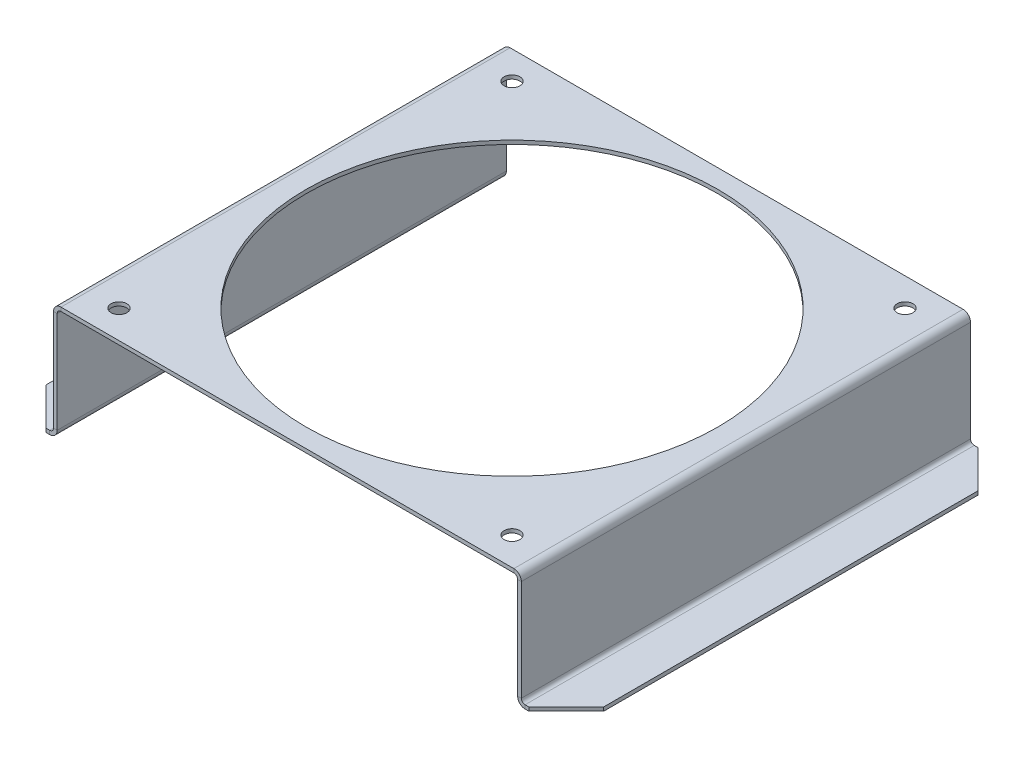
ISO-10303-21;
HEADER;
FILE_DESCRIPTION(('STEP AP214'),'2;1');
FILE_NAME('part.step','',(''),(''),'','','');
FILE_SCHEMA(('AUTOMOTIVE_DESIGN { 1 0 10303 214 1 1 1 1 }'));
ENDSEC;
DATA;
#1=APPLICATION_CONTEXT('core data for automotive mechanical design processes');
#2=APPLICATION_PROTOCOL_DEFINITION('international standard','automotive_design',2000,#1);
#3=PRODUCT_CONTEXT('',#1,'mechanical');
#4=PRODUCT('Part','Part','',(#3));
#5=PRODUCT_RELATED_PRODUCT_CATEGORY('part','',(#4));
#6=PRODUCT_DEFINITION_FORMATION('','',#4);
#7=PRODUCT_DEFINITION_CONTEXT('part definition',#1,'design');
#8=PRODUCT_DEFINITION('design','',#6,#7);
#9=PRODUCT_DEFINITION_SHAPE('','',#8);
#10=(LENGTH_UNIT() NAMED_UNIT(*) SI_UNIT(.MILLI.,.METRE.));
#11=(NAMED_UNIT(*) PLANE_ANGLE_UNIT() SI_UNIT($,.RADIAN.));
#12=(NAMED_UNIT(*) SI_UNIT($,.STERADIAN.) SOLID_ANGLE_UNIT());
#13=UNCERTAINTY_MEASURE_WITH_UNIT(LENGTH_MEASURE(1.E-05),#10,'distance_accuracy_value','');
#14=(GEOMETRIC_REPRESENTATION_CONTEXT(3) GLOBAL_UNCERTAINTY_ASSIGNED_CONTEXT((#13)) GLOBAL_UNIT_ASSIGNED_CONTEXT((#10,
#11,#12)) REPRESENTATION_CONTEXT('',''));
#15=CARTESIAN_POINT('',(0.,0.,0.));
#16=DIRECTION('',(0.,0.,1.));
#17=DIRECTION('',(1.,0.,0.));
#18=AXIS2_PLACEMENT_3D('',#15,#16,#17);
#19=CARTESIAN_POINT('',(-62.4999999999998,-29.,60.));
#20=DIRECTION('',(0.,0.,0.999999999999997));
#21=DIRECTION('',(0.999999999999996,0.,0.));
#22=AXIS2_PLACEMENT_3D('',#19,#20,#21);
#23=PLANE('',#22);
#24=DIRECTION('',(0.999999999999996,0.,0.));
#25=VECTOR('',#24,1.);
#26=CARTESIAN_POINT('',(-62.4999999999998,-29.,60.));
#27=LINE('',#26,#25);
#28=CARTESIAN_POINT('',(-62.4999999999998,-29.,60.));
#29=VERTEX_POINT('',#28);
#30=CARTESIAN_POINT('',(-61.4999999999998,-29.,60.));
#31=VERTEX_POINT('',#30);
#32=EDGE_CURVE('E412',#29,#31,#27,.T.);
#33=ORIENTED_EDGE('',*,*,#32,.F.);
#34=CARTESIAN_POINT('',(-63.4999999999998,-28.9999999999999,59.9999999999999));
#35=DIRECTION('',(0.,0.,-0.999999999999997));
#36=DIRECTION('',(-0.999999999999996,0.,0.));
#37=AXIS2_PLACEMENT_3D('',#34,#35,#36);
#38=CIRCLE('',#37,1.);
#39=CARTESIAN_POINT('',(-63.4999999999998,-29.9999999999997,59.9999999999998));
#40=VERTEX_POINT('',#39);
#41=EDGE_CURVE('E257',#40,#29,#38,.F.);
#42=ORIENTED_EDGE('',*,*,#41,.F.);
#43=DIRECTION('',(0.,1.,0.));
#44=VECTOR('',#43,1.);
#45=CARTESIAN_POINT('',(-63.4999999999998,-31.,59.9999999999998));
#46=LINE('',#45,#44);
#47=CARTESIAN_POINT('',(-63.4999999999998,-31.,59.9999999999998));
#48=VERTEX_POINT('',#47);
#49=EDGE_CURVE('E409',#48,#40,#46,.T.);
#50=ORIENTED_EDGE('',*,*,#49,.F.);
#51=CARTESIAN_POINT('',(-63.4999999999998,-28.9999999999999,59.9999999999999));
#52=DIRECTION('',(0.,0.,0.999999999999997));
#53=DIRECTION('',(0.999999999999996,0.,0.));
#54=AXIS2_PLACEMENT_3D('',#51,#52,#53);
#55=CIRCLE('',#54,2.);
#56=EDGE_CURVE('E264',#48,#31,#55,.T.);
#57=ORIENTED_EDGE('',*,*,#56,.T.);
#58=EDGE_LOOP('',(#33,#42,#50,#57));
#59=FACE_BOUND('',#58,.T.);
#60=ADVANCED_FACE('F38',(#59),#23,.T.);
#61=CARTESIAN_POINT('',(-63.4999999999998,-31.,59.9999999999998));
#62=DIRECTION('',(0.,0.,0.999999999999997));
#63=DIRECTION('',(0.999999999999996,0.,0.));
#64=AXIS2_PLACEMENT_3D('',#61,#62,#63);
#65=PLANE('',#64);
#66=DIRECTION('',(0.,1.,0.));
#67=VECTOR('',#66,1.);
#68=CARTESIAN_POINT('',(-62.4999999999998,1.11022302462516E-13,59.9999999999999));
#69=LINE('',#68,#67);
#70=CARTESIAN_POINT('',(-62.4999999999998,-1.99999999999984,59.9999999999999));
#71=VERTEX_POINT('',#70);
#72=EDGE_CURVE('E254',#29,#71,#69,.T.);
#73=ORIENTED_EDGE('',*,*,#72,.F.);
#74=ORIENTED_EDGE('',*,*,#32,.T.);
#75=DIRECTION('',(0.,1.,0.));
#76=VECTOR('',#75,1.);
#77=CARTESIAN_POINT('',(-61.4999999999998,1.11022302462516E-13,59.9999999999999));
#78=LINE('',#77,#76);
#79=CARTESIAN_POINT('',(-61.4999999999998,-1.99999999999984,59.9999999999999));
#80=VERTEX_POINT('',#79);
#81=EDGE_CURVE('E267',#31,#80,#78,.T.);
#82=ORIENTED_EDGE('',*,*,#81,.T.);
#83=DIRECTION('',(-0.999999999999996,0.,0.));
#84=VECTOR('',#83,1.);
#85=CARTESIAN_POINT('',(-61.4999999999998,-1.99999999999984,59.9999999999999));
#86=LINE('',#85,#84);
#87=EDGE_CURVE('E400',#80,#71,#86,.T.);
#88=ORIENTED_EDGE('',*,*,#87,.T.);
#89=EDGE_LOOP('',(#73,#74,#82,#88));
#90=FACE_BOUND('',#89,.T.);
#91=ADVANCED_FACE('F497',(#90),#65,.T.);
#92=CARTESIAN_POINT('',(-63.4999999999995,-29.9999999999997,-59.9999999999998));
#93=DIRECTION('',(0.,0.,-0.999999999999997));
#94=DIRECTION('',(-0.999999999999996,0.,0.));
#95=AXIS2_PLACEMENT_3D('',#92,#93,#94);
#96=PLANE('',#95);
#97=DIRECTION('',(0.,-1.,0.));
#98=VECTOR('',#97,1.);
#99=CARTESIAN_POINT('',(-63.4999999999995,-29.9999999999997,-59.9999999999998));
#100=LINE('',#99,#98);
#101=CARTESIAN_POINT('',(-63.4999999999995,-29.9999999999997,-59.9999999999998));
#102=VERTEX_POINT('',#101);
#103=CARTESIAN_POINT('',(-63.4999999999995,-31.,-59.9999999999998));
#104=VERTEX_POINT('',#103);
#105=EDGE_CURVE('E406',#102,#104,#100,.T.);
#106=ORIENTED_EDGE('',*,*,#105,.F.);
#107=CARTESIAN_POINT('',(-63.4999999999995,-28.9999999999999,-59.9999999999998));
#108=DIRECTION('',(0.,0.,-0.999999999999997));
#109=DIRECTION('',(-0.999999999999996,0.,0.));
#110=AXIS2_PLACEMENT_3D('',#107,#108,#109);
#111=CIRCLE('',#110,1.);
#112=CARTESIAN_POINT('',(-62.4999999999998,-28.9999999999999,-59.9999999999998));
#113=VERTEX_POINT('',#112);
#114=EDGE_CURVE('E306',#102,#113,#111,.F.);
#115=ORIENTED_EDGE('',*,*,#114,.T.);
#116=DIRECTION('',(-0.999999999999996,0.,0.));
#117=VECTOR('',#116,1.);
#118=CARTESIAN_POINT('',(-61.4999999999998,-28.9999999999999,-59.9999999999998));
#119=LINE('',#118,#117);
#120=CARTESIAN_POINT('',(-61.4999999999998,-28.9999999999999,-59.9999999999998));
#121=VERTEX_POINT('',#120);
#122=EDGE_CURVE('E404',#121,#113,#119,.T.);
#123=ORIENTED_EDGE('',*,*,#122,.F.);
#124=CARTESIAN_POINT('',(-63.4999999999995,-28.9999999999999,-59.9999999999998));
#125=DIRECTION('',(0.,0.,0.999999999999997));
#126=DIRECTION('',(0.999999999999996,0.,0.));
#127=AXIS2_PLACEMENT_3D('',#124,#125,#126);
#128=CIRCLE('',#127,2.);
#129=EDGE_CURVE('E313',#104,#121,#128,.T.);
#130=ORIENTED_EDGE('',*,*,#129,.F.);
#131=EDGE_LOOP('',(#106,#115,#123,#130));
#132=FACE_BOUND('',#131,.T.);
#133=ADVANCED_FACE('F622',(#132),#96,.T.);
#134=CARTESIAN_POINT('',(-61.4999999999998,-28.9999999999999,-59.9999999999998));
#135=DIRECTION('',(0.,0.,-0.999999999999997));
#136=DIRECTION('',(-0.999999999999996,0.,0.));
#137=AXIS2_PLACEMENT_3D('',#134,#135,#136);
#138=PLANE('',#137);
#139=DIRECTION('',(0.999999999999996,0.,0.));
#140=VECTOR('',#139,1.);
#141=CARTESIAN_POINT('',(-62.4999999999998,-31.,-59.9999999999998));
#142=LINE('',#141,#140);
#143=CARTESIAN_POINT('',(-64.4999999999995,-31.,-59.9999999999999));
#144=VERTEX_POINT('',#143);
#145=EDGE_CURVE('E311',#144,#104,#142,.T.);
#146=ORIENTED_EDGE('',*,*,#145,.F.);
#147=DIRECTION('',(0.,1.,0.));
#148=VECTOR('',#147,1.);
#149=CARTESIAN_POINT('',(-64.4999999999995,-28.9999999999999,-59.9999999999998));
#150=LINE('',#149,#148);
#151=CARTESIAN_POINT('',(-64.4999999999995,-29.9999999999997,-59.9999999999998));
#152=VERTEX_POINT('',#151);
#153=EDGE_CURVE('E450',#144,#152,#150,.T.);
#154=ORIENTED_EDGE('',*,*,#153,.T.);
#155=DIRECTION('',(0.999999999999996,0.,0.));
#156=VECTOR('',#155,1.);
#157=CARTESIAN_POINT('',(-62.4999999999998,-29.9999999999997,-59.9999999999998));
#158=LINE('',#157,#156);
#159=EDGE_CURVE('E309',#152,#102,#158,.T.);
#160=ORIENTED_EDGE('',*,*,#159,.T.);
#161=ORIENTED_EDGE('',*,*,#105,.T.);
#162=EDGE_LOOP('',(#146,#154,#160,#161));
#163=FACE_BOUND('',#162,.T.);
#164=ADVANCED_FACE('F470',(#163),#138,.T.);
#165=CARTESIAN_POINT('',(-60.4999999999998,1.11022302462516E-13,59.9999999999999));
#166=DIRECTION('',(0.,0.,0.999999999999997));
#167=DIRECTION('',(0.999999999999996,0.,0.));
#168=AXIS2_PLACEMENT_3D('',#165,#166,#167);
#169=PLANE('',#168);
#170=DIRECTION('',(0.,-1.,0.));
#171=VECTOR('',#170,1.);
#172=CARTESIAN_POINT('',(-60.4999999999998,1.11022302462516E-13,59.9999999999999));
#173=LINE('',#172,#171);
#174=CARTESIAN_POINT('',(-60.4999999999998,1.11022302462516E-13,59.9999999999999));
#175=VERTEX_POINT('',#174);
#176=CARTESIAN_POINT('',(-60.4999999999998,-1.,60.));
#177=VERTEX_POINT('',#176);
#178=EDGE_CURVE('E402',#175,#177,#173,.T.);
#179=ORIENTED_EDGE('',*,*,#178,.F.);
#180=CARTESIAN_POINT('',(-60.4999999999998,-1.99999999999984,59.9999999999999));
#181=DIRECTION('',(0.,0.,0.999999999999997));
#182=DIRECTION('',(0.999999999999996,0.,0.));
#183=AXIS2_PLACEMENT_3D('',#180,#181,#182);
#184=CIRCLE('',#183,2.);
#185=EDGE_CURVE('E251',#71,#175,#184,.F.);
#186=ORIENTED_EDGE('',*,*,#185,.F.);
#187=ORIENTED_EDGE('',*,*,#87,.F.);
#188=CARTESIAN_POINT('',(-60.4999999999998,-1.99999999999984,59.9999999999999));
#189=DIRECTION('',(0.,0.,0.999999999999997));
#190=DIRECTION('',(0.999999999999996,0.,0.));
#191=AXIS2_PLACEMENT_3D('',#188,#189,#190);
#192=CIRCLE('',#191,1.);
#193=EDGE_CURVE('E270',#80,#177,#192,.F.);
#194=ORIENTED_EDGE('',*,*,#193,.T.);
#195=EDGE_LOOP('',(#179,#186,#187,#194));
#196=FACE_BOUND('',#195,.T.);
#197=ADVANCED_FACE('F506',(#196),#169,.T.);
#198=CARTESIAN_POINT('',(-61.4999999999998,-1.99999999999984,59.9999999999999));
#199=DIRECTION('',(0.,0.,0.999999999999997));
#200=DIRECTION('',(0.999999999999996,0.,0.));
#201=AXIS2_PLACEMENT_3D('',#198,#199,#200);
#202=PLANE('',#201);
#203=DIRECTION('',(0.999999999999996,0.,0.));
#204=VECTOR('',#203,1.);
#205=CARTESIAN_POINT('',(62.4999999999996,1.11022302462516E-13,59.9999999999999));
#206=LINE('',#205,#204);
#207=CARTESIAN_POINT('',(60.4999999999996,1.11022302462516E-13,59.9999999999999));
#208=VERTEX_POINT('',#207);
#209=EDGE_CURVE('E248',#175,#208,#206,.T.);
#210=ORIENTED_EDGE('',*,*,#209,.F.);
#211=ORIENTED_EDGE('',*,*,#178,.T.);
#212=DIRECTION('',(0.999999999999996,0.,0.));
#213=VECTOR('',#212,1.);
#214=CARTESIAN_POINT('',(62.4999999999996,-0.999999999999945,59.9999999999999));
#215=LINE('',#214,#213);
#216=CARTESIAN_POINT('',(60.4999999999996,-0.999999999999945,59.9999999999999));
#217=VERTEX_POINT('',#216);
#218=EDGE_CURVE('E273',#177,#217,#215,.T.);
#219=ORIENTED_EDGE('',*,*,#218,.T.);
#220=DIRECTION('',(0.,1.,0.));
#221=VECTOR('',#220,1.);
#222=CARTESIAN_POINT('',(60.4999999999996,-0.999999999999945,59.9999999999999));
#223=LINE('',#222,#221);
#224=EDGE_CURVE('E392',#217,#208,#223,.T.);
#225=ORIENTED_EDGE('',*,*,#224,.T.);
#226=EDGE_LOOP('',(#210,#211,#219,#225));
#227=FACE_BOUND('',#226,.T.);
#228=ADVANCED_FACE('F515',(#227),#202,.T.);
#229=CARTESIAN_POINT('',(-62.4999999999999,-1.99999999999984,-59.9999999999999));
#230=DIRECTION('',(0.,0.,-0.999999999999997));
#231=DIRECTION('',(-0.999999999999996,0.,0.));
#232=AXIS2_PLACEMENT_3D('',#229,#230,#231);
#233=PLANE('',#232);
#234=DIRECTION('',(0.999999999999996,0.,0.));
#235=VECTOR('',#234,1.);
#236=CARTESIAN_POINT('',(-62.4999999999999,-1.99999999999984,-59.9999999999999));
#237=LINE('',#236,#235);
#238=CARTESIAN_POINT('',(-62.4999999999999,-1.99999999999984,-59.9999999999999));
#239=VERTEX_POINT('',#238);
#240=CARTESIAN_POINT('',(-61.4999999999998,-1.99999999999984,-59.9999999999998));
#241=VERTEX_POINT('',#240);
#242=EDGE_CURVE('E398',#239,#241,#237,.T.);
#243=ORIENTED_EDGE('',*,*,#242,.F.);
#244=CARTESIAN_POINT('',(-60.4999999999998,-1.99999999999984,-59.9999999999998));
#245=DIRECTION('',(0.,0.,0.999999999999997));
#246=DIRECTION('',(0.999999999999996,0.,0.));
#247=AXIS2_PLACEMENT_3D('',#244,#245,#246);
#248=CIRCLE('',#247,2.);
#249=CARTESIAN_POINT('',(-60.4999999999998,1.11022302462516E-13,-59.9999999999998));
#250=VERTEX_POINT('',#249);
#251=EDGE_CURVE('E300',#239,#250,#248,.F.);
#252=ORIENTED_EDGE('',*,*,#251,.T.);
#253=DIRECTION('',(0.,1.,0.));
#254=VECTOR('',#253,1.);
#255=CARTESIAN_POINT('',(-60.4999999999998,-1.,-59.9999999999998));
#256=LINE('',#255,#254);
#257=CARTESIAN_POINT('',(-60.4999999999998,-1.,-59.9999999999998));
#258=VERTEX_POINT('',#257);
#259=EDGE_CURVE('E396',#258,#250,#256,.T.);
#260=ORIENTED_EDGE('',*,*,#259,.F.);
#261=CARTESIAN_POINT('',(-60.4999999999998,-1.99999999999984,-59.9999999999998));
#262=DIRECTION('',(0.,0.,0.999999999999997));
#263=DIRECTION('',(0.999999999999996,0.,0.));
#264=AXIS2_PLACEMENT_3D('',#261,#262,#263);
#265=CIRCLE('',#264,1.);
#266=EDGE_CURVE('E319',#241,#258,#265,.F.);
#267=ORIENTED_EDGE('',*,*,#266,.F.);
#268=EDGE_LOOP('',(#243,#252,#260,#267));
#269=FACE_BOUND('',#268,.T.);
#270=ADVANCED_FACE('F634',(#269),#233,.T.);
#271=CARTESIAN_POINT('',(-60.4999999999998,-1.,-59.9999999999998));
#272=DIRECTION('',(0.,0.,-0.999999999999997));
#273=DIRECTION('',(-0.999999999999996,0.,0.));
#274=AXIS2_PLACEMENT_3D('',#271,#272,#273);
#275=PLANE('',#274);
#276=DIRECTION('',(0.,1.,0.));
#277=VECTOR('',#276,1.);
#278=CARTESIAN_POINT('',(-62.4999999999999,1.11022302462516E-13,-59.9999999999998));
#279=LINE('',#278,#277);
#280=EDGE_CURVE('E303',#113,#239,#279,.T.);
#281=ORIENTED_EDGE('',*,*,#280,.T.);
#282=ORIENTED_EDGE('',*,*,#242,.T.);
#283=DIRECTION('',(0.,1.,0.));
#284=VECTOR('',#283,1.);
#285=CARTESIAN_POINT('',(-61.4999999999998,1.11022302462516E-13,-59.9999999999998));
#286=LINE('',#285,#284);
#287=EDGE_CURVE('E316',#121,#241,#286,.T.);
#288=ORIENTED_EDGE('',*,*,#287,.F.);
#289=ORIENTED_EDGE('',*,*,#122,.T.);
#290=EDGE_LOOP('',(#281,#282,#288,#289));
#291=FACE_BOUND('',#290,.T.);
#292=ADVANCED_FACE('F637',(#291),#275,.T.);
#293=CARTESIAN_POINT('',(62.4999999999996,-1.99999999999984,59.9999999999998));
#294=DIRECTION('',(0.,0.,0.999999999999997));
#295=DIRECTION('',(0.999999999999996,0.,0.));
#296=AXIS2_PLACEMENT_3D('',#293,#294,#295);
#297=PLANE('',#296);
#298=DIRECTION('',(-0.999999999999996,0.,0.));
#299=VECTOR('',#298,1.);
#300=CARTESIAN_POINT('',(62.4999999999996,-1.99999999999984,59.9999999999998));
#301=LINE('',#300,#299);
#302=CARTESIAN_POINT('',(62.4999999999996,-1.99999999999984,59.9999999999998));
#303=VERTEX_POINT('',#302);
#304=CARTESIAN_POINT('',(61.4999999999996,-1.99999999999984,59.9999999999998));
#305=VERTEX_POINT('',#304);
#306=EDGE_CURVE('E394',#303,#305,#301,.T.);
#307=ORIENTED_EDGE('',*,*,#306,.F.);
#308=CARTESIAN_POINT('',(60.4999999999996,-1.99999999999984,59.9999999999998));
#309=DIRECTION('',(0.,0.,0.999999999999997));
#310=DIRECTION('',(0.999999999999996,0.,0.));
#311=AXIS2_PLACEMENT_3D('',#308,#309,#310);
#312=CIRCLE('',#311,2.);
#313=EDGE_CURVE('E242',#208,#303,#312,.F.);
#314=ORIENTED_EDGE('',*,*,#313,.F.);
#315=ORIENTED_EDGE('',*,*,#224,.F.);
#316=CARTESIAN_POINT('',(60.4999999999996,-1.99999999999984,59.9999999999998));
#317=DIRECTION('',(0.,0.,0.999999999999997));
#318=DIRECTION('',(0.999999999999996,0.,0.));
#319=AXIS2_PLACEMENT_3D('',#316,#317,#318);
#320=CIRCLE('',#319,1.);
#321=EDGE_CURVE('E276',#217,#305,#320,.F.);
#322=ORIENTED_EDGE('',*,*,#321,.T.);
#323=EDGE_LOOP('',(#307,#314,#315,#322));
#324=FACE_BOUND('',#323,.T.);
#325=ADVANCED_FACE('F524',(#324),#297,.T.);
#326=CARTESIAN_POINT('',(60.4999999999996,-0.999999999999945,59.9999999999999));
#327=DIRECTION('',(0.,0.,0.999999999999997));
#328=DIRECTION('',(0.999999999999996,0.,0.));
#329=AXIS2_PLACEMENT_3D('',#326,#327,#328);
#330=PLANE('',#329);
#331=DIRECTION('',(0.,-1.,0.));
#332=VECTOR('',#331,1.);
#333=CARTESIAN_POINT('',(62.4999999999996,1.11022302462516E-13,59.9999999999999));
#334=LINE('',#333,#332);
#335=CARTESIAN_POINT('',(62.4999999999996,-29.,59.9999999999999));
#336=VERTEX_POINT('',#335);
#337=EDGE_CURVE('E240',#303,#336,#334,.T.);
#338=ORIENTED_EDGE('',*,*,#337,.F.);
#339=ORIENTED_EDGE('',*,*,#306,.T.);
#340=DIRECTION('',(0.,-1.,0.));
#341=VECTOR('',#340,1.);
#342=CARTESIAN_POINT('',(61.4999999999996,1.11022302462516E-13,59.9999999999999));
#343=LINE('',#342,#341);
#344=CARTESIAN_POINT('',(61.4999999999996,-29.,59.9999999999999));
#345=VERTEX_POINT('',#344);
#346=EDGE_CURVE('E279',#305,#345,#343,.T.);
#347=ORIENTED_EDGE('',*,*,#346,.T.);
#348=DIRECTION('',(0.999999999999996,0.,0.));
#349=VECTOR('',#348,1.);
#350=CARTESIAN_POINT('',(61.4999999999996,-29.,59.9999999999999));
#351=LINE('',#350,#349);
#352=EDGE_CURVE('E213',#345,#336,#351,.T.);
#353=ORIENTED_EDGE('',*,*,#352,.T.);
#354=EDGE_LOOP('',(#338,#339,#347,#353));
#355=FACE_BOUND('',#354,.T.);
#356=ADVANCED_FACE('F533',(#355),#330,.T.);
#357=CARTESIAN_POINT('',(60.4999999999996,1.66533453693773E-13,-59.9999999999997));
#358=DIRECTION('',(0.,0.,-0.999999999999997));
#359=DIRECTION('',(-0.999999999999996,0.,0.));
#360=AXIS2_PLACEMENT_3D('',#357,#358,#359);
#361=PLANE('',#360);
#362=DIRECTION('',(0.,-1.,0.));
#363=VECTOR('',#362,1.);
#364=CARTESIAN_POINT('',(60.4999999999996,1.66533453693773E-13,-59.9999999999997));
#365=LINE('',#364,#363);
#366=CARTESIAN_POINT('',(60.4999999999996,1.66533453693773E-13,-59.9999999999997));
#367=VERTEX_POINT('',#366);
#368=CARTESIAN_POINT('',(60.4999999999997,-0.999999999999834,-59.9999999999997));
#369=VERTEX_POINT('',#368);
#370=EDGE_CURVE('E390',#367,#369,#365,.T.);
#371=ORIENTED_EDGE('',*,*,#370,.F.);
#372=CARTESIAN_POINT('',(60.4999999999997,-1.99999999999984,-59.9999999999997));
#373=DIRECTION('',(0.,0.,0.999999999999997));
#374=DIRECTION('',(0.999999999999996,0.,0.));
#375=AXIS2_PLACEMENT_3D('',#372,#373,#374);
#376=CIRCLE('',#375,2.);
#377=CARTESIAN_POINT('',(62.4999999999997,-1.99999999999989,-59.9999999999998));
#378=VERTEX_POINT('',#377);
#379=EDGE_CURVE('E294',#367,#378,#376,.F.);
#380=ORIENTED_EDGE('',*,*,#379,.T.);
#381=DIRECTION('',(0.999999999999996,0.,0.));
#382=VECTOR('',#381,1.);
#383=CARTESIAN_POINT('',(61.4999999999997,-1.99999999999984,-59.9999999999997));
#384=LINE('',#383,#382);
#385=CARTESIAN_POINT('',(61.4999999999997,-1.99999999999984,-59.9999999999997));
#386=VERTEX_POINT('',#385);
#387=EDGE_CURVE('E212',#386,#378,#384,.T.);
#388=ORIENTED_EDGE('',*,*,#387,.F.);
#389=CARTESIAN_POINT('',(60.4999999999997,-1.99999999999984,-59.9999999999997));
#390=DIRECTION('',(0.,0.,0.999999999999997));
#391=DIRECTION('',(0.999999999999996,0.,0.));
#392=AXIS2_PLACEMENT_3D('',#389,#390,#391);
#393=CIRCLE('',#392,1.);
#394=EDGE_CURVE('E325',#369,#386,#393,.F.);
#395=ORIENTED_EDGE('',*,*,#394,.F.);
#396=EDGE_LOOP('',(#371,#380,#388,#395));
#397=FACE_BOUND('',#396,.T.);
#398=ADVANCED_FACE('F593',(#397),#361,.T.);
#399=CARTESIAN_POINT('',(61.4999999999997,-1.99999999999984,-59.9999999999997));
#400=DIRECTION('',(0.,0.,-0.999999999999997));
#401=DIRECTION('',(-0.999999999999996,0.,0.));
#402=AXIS2_PLACEMENT_3D('',#399,#400,#401);
#403=PLANE('',#402);
#404=DIRECTION('',(0.999999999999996,0.,0.));
#405=VECTOR('',#404,1.);
#406=CARTESIAN_POINT('',(62.4999999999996,1.66533453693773E-13,-59.9999999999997));
#407=LINE('',#406,#405);
#408=EDGE_CURVE('E297',#250,#367,#407,.T.);
#409=ORIENTED_EDGE('',*,*,#408,.T.);
#410=ORIENTED_EDGE('',*,*,#370,.T.);
#411=DIRECTION('',(0.999999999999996,0.,0.));
#412=VECTOR('',#411,1.);
#413=CARTESIAN_POINT('',(62.4999999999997,-0.999999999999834,-59.9999999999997));
#414=LINE('',#413,#412);
#415=EDGE_CURVE('E322',#258,#369,#414,.T.);
#416=ORIENTED_EDGE('',*,*,#415,.F.);
#417=ORIENTED_EDGE('',*,*,#259,.T.);
#418=EDGE_LOOP('',(#409,#410,#416,#417));
#419=FACE_BOUND('',#418,.T.);
#420=ADVANCED_FACE('F648',(#419),#403,.T.);
#421=CARTESIAN_POINT('',(63.4999999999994,-30.0000000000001,59.9999999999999));
#422=DIRECTION('',(0.,0.,0.999999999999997));
#423=DIRECTION('',(0.999999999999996,0.,0.));
#424=AXIS2_PLACEMENT_3D('',#421,#422,#423);
#425=PLANE('',#424);
#426=DIRECTION('',(0.,-1.,0.));
#427=VECTOR('',#426,1.);
#428=CARTESIAN_POINT('',(63.4999999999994,-30.0000000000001,59.9999999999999));
#429=LINE('',#428,#427);
#430=CARTESIAN_POINT('',(63.4999999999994,-30.0000000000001,59.9999999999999));
#431=VERTEX_POINT('',#430);
#432=CARTESIAN_POINT('',(63.4999999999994,-31.,59.9999999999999));
#433=VERTEX_POINT('',#432);
#434=EDGE_CURVE('E200',#431,#433,#429,.T.);
#435=ORIENTED_EDGE('',*,*,#434,.F.);
#436=CARTESIAN_POINT('',(63.4999999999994,-29.,59.9999999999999));
#437=DIRECTION('',(0.,0.,-0.999999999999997));
#438=DIRECTION('',(-0.999999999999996,0.,0.));
#439=AXIS2_PLACEMENT_3D('',#436,#437,#438);
#440=CIRCLE('',#439,1.);
#441=EDGE_CURVE('E204',#336,#431,#440,.F.);
#442=ORIENTED_EDGE('',*,*,#441,.F.);
#443=ORIENTED_EDGE('',*,*,#352,.F.);
#444=CARTESIAN_POINT('',(63.4999999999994,-29.,59.9999999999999));
#445=DIRECTION('',(0.,0.,0.999999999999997));
#446=DIRECTION('',(0.999999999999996,0.,0.));
#447=AXIS2_PLACEMENT_3D('',#444,#445,#446);
#448=CIRCLE('',#447,2.);
#449=EDGE_CURVE('E207',#345,#433,#448,.T.);
#450=ORIENTED_EDGE('',*,*,#449,.T.);
#451=EDGE_LOOP('',(#435,#442,#443,#450));
#452=FACE_BOUND('',#451,.T.);
#453=ADVANCED_FACE('F202',(#452),#425,.T.);
#454=CARTESIAN_POINT('',(61.4999999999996,-29.,59.9999999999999));
#455=DIRECTION('',(0.,0.,0.999999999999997));
#456=DIRECTION('',(0.999999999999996,0.,0.));
#457=AXIS2_PLACEMENT_3D('',#454,#455,#456);
#458=PLANE('',#457);
#459=DIRECTION('',(0.999999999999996,0.,0.));
#460=VECTOR('',#459,1.);
#461=CARTESIAN_POINT('',(62.4999999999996,-31.,59.9999999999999));
#462=LINE('',#461,#460);
#463=CARTESIAN_POINT('',(64.4999999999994,-31.0000000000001,59.9999999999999));
#464=VERTEX_POINT('',#463);
#465=EDGE_CURVE('E235',#433,#464,#462,.T.);
#466=ORIENTED_EDGE('',*,*,#465,.T.);
#467=DIRECTION('',(0.,1.,0.));
#468=VECTOR('',#467,1.);
#469=CARTESIAN_POINT('',(64.4999999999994,-29.,60.));
#470=LINE('',#469,#468);
#471=CARTESIAN_POINT('',(64.4999999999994,-30.0000000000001,60.));
#472=VERTEX_POINT('',#471);
#473=EDGE_CURVE('E234',#464,#472,#470,.T.);
#474=ORIENTED_EDGE('',*,*,#473,.T.);
#475=DIRECTION('',(0.999999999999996,0.,0.));
#476=VECTOR('',#475,1.);
#477=CARTESIAN_POINT('',(62.4999999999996,-30.0000000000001,59.9999999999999));
#478=LINE('',#477,#476);
#479=EDGE_CURVE('E222',#431,#472,#478,.T.);
#480=ORIENTED_EDGE('',*,*,#479,.F.);
#481=ORIENTED_EDGE('',*,*,#434,.T.);
#482=EDGE_LOOP('',(#466,#474,#480,#481));
#483=FACE_BOUND('',#482,.T.);
#484=ADVANCED_FACE('F232',(#483),#458,.T.);
#485=CARTESIAN_POINT('',(62.4999999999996,-28.9999999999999,-59.9999999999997));
#486=DIRECTION('',(0.,0.,-0.999999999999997));
#487=DIRECTION('',(-0.999999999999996,0.,0.));
#488=AXIS2_PLACEMENT_3D('',#485,#486,#487);
#489=PLANE('',#488);
#490=DIRECTION('',(-0.999999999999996,0.,0.));
#491=VECTOR('',#490,1.);
#492=CARTESIAN_POINT('',(62.4999999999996,-28.9999999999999,-59.9999999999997));
#493=LINE('',#492,#491);
#494=CARTESIAN_POINT('',(62.4999999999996,-28.9999999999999,-59.9999999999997));
#495=VERTEX_POINT('',#494);
#496=CARTESIAN_POINT('',(61.4999999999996,-28.9999999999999,-59.9999999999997));
#497=VERTEX_POINT('',#496);
#498=EDGE_CURVE('E386',#495,#497,#493,.T.);
#499=ORIENTED_EDGE('',*,*,#498,.F.);
#500=CARTESIAN_POINT('',(63.4999999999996,-28.9999999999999,-59.9999999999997));
#501=DIRECTION('',(0.,0.,-0.999999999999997));
#502=DIRECTION('',(-0.999999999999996,0.,0.));
#503=AXIS2_PLACEMENT_3D('',#500,#501,#502);
#504=CIRCLE('',#503,1.);
#505=CARTESIAN_POINT('',(63.4999999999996,-30.,-59.9999999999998));
#506=VERTEX_POINT('',#505);
#507=EDGE_CURVE('E289',#495,#506,#504,.F.);
#508=ORIENTED_EDGE('',*,*,#507,.T.);
#509=DIRECTION('',(0.,1.,0.));
#510=VECTOR('',#509,1.);
#511=CARTESIAN_POINT('',(63.4999999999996,-30.9999999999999,-59.9999999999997));
#512=LINE('',#511,#510);
#513=CARTESIAN_POINT('',(63.4999999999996,-30.9999999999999,-59.9999999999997));
#514=VERTEX_POINT('',#513);
#515=EDGE_CURVE('E384',#514,#506,#512,.T.);
#516=ORIENTED_EDGE('',*,*,#515,.F.);
#517=CARTESIAN_POINT('',(63.4999999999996,-28.9999999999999,-59.9999999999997));
#518=DIRECTION('',(0.,0.,0.999999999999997));
#519=DIRECTION('',(0.999999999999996,0.,0.));
#520=AXIS2_PLACEMENT_3D('',#517,#518,#519);
#521=CIRCLE('',#520,2.);
#522=EDGE_CURVE('E331',#497,#514,#521,.T.);
#523=ORIENTED_EDGE('',*,*,#522,.F.);
#524=EDGE_LOOP('',(#499,#508,#516,#523));
#525=FACE_BOUND('',#524,.T.);
#526=ADVANCED_FACE('F597',(#525),#489,.T.);
#527=CARTESIAN_POINT('',(63.4999999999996,-30.9999999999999,-59.9999999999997));
#528=DIRECTION('',(0.,0.,-0.999999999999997));
#529=DIRECTION('',(-0.999999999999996,0.,0.));
#530=AXIS2_PLACEMENT_3D('',#527,#528,#529);
#531=PLANE('',#530);
#532=DIRECTION('',(0.,-1.,0.));
#533=VECTOR('',#532,1.);
#534=CARTESIAN_POINT('',(62.4999999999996,1.66533453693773E-13,-59.9999999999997));
#535=LINE('',#534,#533);
#536=EDGE_CURVE('E291',#378,#495,#535,.T.);
#537=ORIENTED_EDGE('',*,*,#536,.T.);
#538=ORIENTED_EDGE('',*,*,#498,.T.);
#539=DIRECTION('',(0.,-1.,0.));
#540=VECTOR('',#539,1.);
#541=CARTESIAN_POINT('',(61.4999999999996,1.66533453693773E-13,-59.9999999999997));
#542=LINE('',#541,#540);
#543=EDGE_CURVE('E328',#386,#497,#542,.T.);
#544=ORIENTED_EDGE('',*,*,#543,.F.);
#545=ORIENTED_EDGE('',*,*,#387,.T.);
#546=EDGE_LOOP('',(#537,#538,#544,#545));
#547=FACE_BOUND('',#546,.T.);
#548=ADVANCED_FACE('F595',(#547),#531,.T.);
#549=CARTESIAN_POINT('',(62.4999999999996,-31.,59.9999999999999));
#550=DIRECTION('',(0.,1.,0.));
#551=DIRECTION('',(0.,0.,0.999999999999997));
#552=AXIS2_PLACEMENT_3D('',#549,#550,#551);
#553=PLANE('',#552);
#554=DIRECTION('',(0.999999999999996,0.,0.));
#555=VECTOR('',#554,1.);
#556=CARTESIAN_POINT('',(62.4999999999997,-30.9999999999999,-59.9999999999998));
#557=LINE('',#556,#555);
#558=CARTESIAN_POINT('',(64.4999999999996,-30.9999999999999,-59.9999999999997));
#559=VERTEX_POINT('',#558);
#560=EDGE_CURVE('E284',#514,#559,#557,.T.);
#561=ORIENTED_EDGE('',*,*,#560,.T.);
#562=DIRECTION('',(-0.707106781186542,0.,-0.707106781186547));
#563=VECTOR('',#562,1.);
#564=CARTESIAN_POINT('',(64.4999999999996,-30.9999999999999,-59.9999999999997));
#565=LINE('',#564,#563);
#566=CARTESIAN_POINT('',(74.4999999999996,-31.,-49.9999999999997));
#567=VERTEX_POINT('',#566);
#568=EDGE_CURVE('E438',#559,#567,#565,.F.);
#569=ORIENTED_EDGE('',*,*,#568,.T.);
#570=DIRECTION('',(0.,0.,-0.999999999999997));
#571=VECTOR('',#570,1.);
#572=CARTESIAN_POINT('',(74.4999999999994,-31.0000000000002,59.9999999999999));
#573=LINE('',#572,#571);
#574=CARTESIAN_POINT('',(74.4999999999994,-31.0000000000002,49.9999999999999));
#575=VERTEX_POINT('',#574);
#576=EDGE_CURVE('E381',#575,#567,#573,.T.);
#577=ORIENTED_EDGE('',*,*,#576,.F.);
#578=DIRECTION('',(0.707106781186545,0.,-0.707106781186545));
#579=VECTOR('',#578,1.);
#580=CARTESIAN_POINT('',(74.4999999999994,-31.0000000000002,49.9999999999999));
#581=LINE('',#580,#579);
#582=EDGE_CURVE('E436',#575,#464,#581,.F.);
#583=ORIENTED_EDGE('',*,*,#582,.T.);
#584=ORIENTED_EDGE('',*,*,#465,.F.);
#585=DIRECTION('',(0.,0.,-0.999999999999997));
#586=VECTOR('',#585,1.);
#587=CARTESIAN_POINT('',(63.4999999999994,-31.,59.9999999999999));
#588=LINE('',#587,#586);
#589=EDGE_CURVE('E283',#433,#514,#588,.T.);
#590=ORIENTED_EDGE('',*,*,#589,.T.);
#591=EDGE_LOOP('',(#561,#569,#577,#583,#584,#590));
#592=FACE_BOUND('',#591,.T.);
#593=ADVANCED_FACE('F545',(#592),#553,.F.);
#594=CARTESIAN_POINT('',(74.4999999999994,-30.0000000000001,59.9999999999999));
#595=DIRECTION('',(0.999999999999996,0.,0.));
#596=DIRECTION('',(0.,0.,-0.999999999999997));
#597=AXIS2_PLACEMENT_3D('',#594,#595,#596);
#598=PLANE('',#597);
#599=ORIENTED_EDGE('',*,*,#576,.T.);
#600=DIRECTION('',(0.,1.,0.));
#601=VECTOR('',#600,1.);
#602=CARTESIAN_POINT('',(74.4999999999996,-30.0000000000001,-49.9999999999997));
#603=LINE('',#602,#601);
#604=CARTESIAN_POINT('',(74.4999999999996,-30.,-49.9999999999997));
#605=VERTEX_POINT('',#604);
#606=EDGE_CURVE('E443',#567,#605,#603,.T.);
#607=ORIENTED_EDGE('',*,*,#606,.T.);
#608=DIRECTION('',(0.,0.,-0.999999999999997));
#609=VECTOR('',#608,1.);
#610=CARTESIAN_POINT('',(74.4999999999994,-30.0000000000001,59.9999999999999));
#611=LINE('',#610,#609);
#612=CARTESIAN_POINT('',(74.4999999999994,-29.9999999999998,49.9999999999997));
#613=VERTEX_POINT('',#612);
#614=EDGE_CURVE('E229',#613,#605,#611,.T.);
#615=ORIENTED_EDGE('',*,*,#614,.F.);
#616=DIRECTION('',(0.,-1.,0.));
#617=VECTOR('',#616,1.);
#618=CARTESIAN_POINT('',(74.4999999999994,-29.9999999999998,49.9999999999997));
#619=LINE('',#618,#617);
#620=EDGE_CURVE('E440',#613,#575,#619,.T.);
#621=ORIENTED_EDGE('',*,*,#620,.T.);
#622=EDGE_LOOP('',(#599,#607,#615,#621));
#623=FACE_BOUND('',#622,.T.);
#624=ADVANCED_FACE('F603',(#623),#598,.T.);
#625=CARTESIAN_POINT('',(62.4999999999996,-30.0000000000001,59.9999999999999));
#626=DIRECTION('',(0.,1.,0.));
#627=DIRECTION('',(0.,0.,0.999999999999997));
#628=AXIS2_PLACEMENT_3D('',#625,#626,#627);
#629=PLANE('',#628);
#630=ORIENTED_EDGE('',*,*,#614,.T.);
#631=DIRECTION('',(0.707106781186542,0.,0.707106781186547));
#632=VECTOR('',#631,1.);
#633=CARTESIAN_POINT('',(123.499999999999,-30.,-0.999999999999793));
#634=LINE('',#633,#632);
#635=CARTESIAN_POINT('',(64.4999999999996,-30.,-59.9999999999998));
#636=VERTEX_POINT('',#635);
#637=EDGE_CURVE('E447',#605,#636,#634,.F.);
#638=ORIENTED_EDGE('',*,*,#637,.T.);
#639=DIRECTION('',(0.999999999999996,0.,0.));
#640=VECTOR('',#639,1.);
#641=CARTESIAN_POINT('',(62.4999999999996,-30.,-59.9999999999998));
#642=LINE('',#641,#640);
#643=EDGE_CURVE('E225',#506,#636,#642,.T.);
#644=ORIENTED_EDGE('',*,*,#643,.F.);
#645=DIRECTION('',(0.,0.,-0.999999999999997));
#646=VECTOR('',#645,1.);
#647=CARTESIAN_POINT('',(63.4999999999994,-30.0000000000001,59.9999999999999));
#648=LINE('',#647,#646);
#649=EDGE_CURVE('E219',#431,#506,#648,.T.);
#650=ORIENTED_EDGE('',*,*,#649,.F.);
#651=ORIENTED_EDGE('',*,*,#479,.T.);
#652=DIRECTION('',(-0.707106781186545,0.,0.707106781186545));
#653=VECTOR('',#652,1.);
#654=CARTESIAN_POINT('',(63.4999999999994,-30.,60.9999999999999));
#655=LINE('',#654,#653);
#656=EDGE_CURVE('E445',#472,#613,#655,.F.);
#657=ORIENTED_EDGE('',*,*,#656,.T.);
#658=EDGE_LOOP('',(#630,#638,#644,#650,#651,#657));
#659=FACE_BOUND('',#658,.T.);
#660=ADVANCED_FACE('F221',(#659),#629,.T.);
#661=CARTESIAN_POINT('',(63.4999999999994,-29.,59.9999999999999));
#662=DIRECTION('',(0.,0.,-0.999999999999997));
#663=DIRECTION('',(-0.999999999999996,0.,0.));
#664=AXIS2_PLACEMENT_3D('',#661,#662,#663);
#665=CYLINDRICAL_SURFACE('',#664,1.);
#666=ORIENTED_EDGE('',*,*,#507,.F.);
#667=DIRECTION('',(0.,0.,-0.999999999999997));
#668=VECTOR('',#667,1.);
#669=CARTESIAN_POINT('',(62.4999999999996,-29.,59.9999999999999));
#670=LINE('',#669,#668);
#671=EDGE_CURVE('E230',#336,#495,#670,.T.);
#672=ORIENTED_EDGE('',*,*,#671,.F.);
#673=ORIENTED_EDGE('',*,*,#441,.T.);
#674=ORIENTED_EDGE('',*,*,#649,.T.);
#675=EDGE_LOOP('',(#666,#672,#673,#674));
#676=FACE_BOUND('',#675,.T.);
#677=ADVANCED_FACE('F238',(#676),#665,.F.);
#678=CARTESIAN_POINT('',(62.4999999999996,1.11022302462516E-13,59.9999999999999));
#679=DIRECTION('',(0.999999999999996,0.,0.));
#680=DIRECTION('',(0.,1.,0.));
#681=AXIS2_PLACEMENT_3D('',#678,#679,#680);
#682=PLANE('',#681);
#683=ORIENTED_EDGE('',*,*,#536,.F.);
#684=DIRECTION('',(0.,0.,-0.999999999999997));
#685=VECTOR('',#684,1.);
#686=CARTESIAN_POINT('',(62.4999999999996,-1.99999999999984,59.9999999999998));
#687=LINE('',#686,#685);
#688=EDGE_CURVE('E376',#303,#378,#687,.T.);
#689=ORIENTED_EDGE('',*,*,#688,.F.);
#690=ORIENTED_EDGE('',*,*,#337,.T.);
#691=ORIENTED_EDGE('',*,*,#671,.T.);
#692=EDGE_LOOP('',(#683,#689,#690,#691));
#693=FACE_BOUND('',#692,.T.);
#694=ADVANCED_FACE('F532',(#693),#682,.T.);
#695=CARTESIAN_POINT('',(60.4999999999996,-1.99999999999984,59.9999999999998));
#696=DIRECTION('',(0.,0.,-0.999999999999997));
#697=DIRECTION('',(-0.999999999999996,0.,0.));
#698=AXIS2_PLACEMENT_3D('',#695,#696,#697);
#699=CYLINDRICAL_SURFACE('',#698,2.);
#700=ORIENTED_EDGE('',*,*,#379,.F.);
#701=DIRECTION('',(0.,0.,-0.999999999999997));
#702=VECTOR('',#701,1.);
#703=CARTESIAN_POINT('',(60.4999999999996,1.11022302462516E-13,59.9999999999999));
#704=LINE('',#703,#702);
#705=EDGE_CURVE('E373',#208,#367,#704,.T.);
#706=ORIENTED_EDGE('',*,*,#705,.F.);
#707=ORIENTED_EDGE('',*,*,#313,.T.);
#708=ORIENTED_EDGE('',*,*,#688,.T.);
#709=EDGE_LOOP('',(#700,#706,#707,#708));
#710=FACE_BOUND('',#709,.T.);
#711=ADVANCED_FACE('F523',(#710),#699,.T.);
#712=CARTESIAN_POINT('',(62.4999999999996,1.11022302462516E-13,59.9999999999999));
#713=DIRECTION('',(0.,1.,0.));
#714=DIRECTION('',(0.,0.,0.999999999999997));
#715=AXIS2_PLACEMENT_3D('',#712,#713,#714);
#716=PLANE('',#715);
#717=CARTESIAN_POINT('',(-52.4999999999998,1.66533453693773E-13,-52.4999999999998));
#718=DIRECTION('',(0.,1.,0.));
#719=DIRECTION('',(0.,0.,0.999999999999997));
#720=AXIS2_PLACEMENT_3D('',#717,#718,#719);
#721=CIRCLE('',#720,2.1);
#722=CARTESIAN_POINT('',(-52.4999999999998,1.67116320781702E-13,-50.3999999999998));
#723=VERTEX_POINT('',#722);
#724=EDGE_CURVE('E433',#723,#723,#721,.T.);
#725=ORIENTED_EDGE('',*,*,#724,.F.);
#726=EDGE_LOOP('',(#725));
#727=FACE_BOUND('',#726,.T.);
#728=CARTESIAN_POINT('',(52.4999999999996,1.66533453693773E-13,-52.4999999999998));
#729=DIRECTION('',(0.,1.,0.));
#730=DIRECTION('',(0.,0.,0.999999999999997));
#731=AXIS2_PLACEMENT_3D('',#728,#729,#730);
#732=CIRCLE('',#731,2.1);
#733=CARTESIAN_POINT('',(52.4999999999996,1.67116320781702E-13,-50.3999999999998));
#734=VERTEX_POINT('',#733);
#735=EDGE_CURVE('E429',#734,#734,#732,.T.);
#736=ORIENTED_EDGE('',*,*,#735,.F.);
#737=EDGE_LOOP('',(#736));
#738=FACE_BOUND('',#737,.T.);
#739=CARTESIAN_POINT('',(-52.4999999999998,1.66533453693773E-13,52.5));
#740=DIRECTION('',(0.,1.,0.));
#741=DIRECTION('',(0.,0.,0.999999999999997));
#742=AXIS2_PLACEMENT_3D('',#739,#740,#741);
#743=CIRCLE('',#742,2.1);
#744=CARTESIAN_POINT('',(-52.4999999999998,1.67116320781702E-13,54.6));
#745=VERTEX_POINT('',#744);
#746=EDGE_CURVE('E425',#745,#745,#743,.T.);
#747=ORIENTED_EDGE('',*,*,#746,.F.);
#748=EDGE_LOOP('',(#747));
#749=FACE_BOUND('',#748,.T.);
#750=CARTESIAN_POINT('',(52.4999999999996,2.22044604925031E-13,52.4999999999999));
#751=DIRECTION('',(0.,1.,0.));
#752=DIRECTION('',(0.,0.,0.999999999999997));
#753=AXIS2_PLACEMENT_3D('',#750,#751,#752);
#754=CIRCLE('',#753,2.1);
#755=CARTESIAN_POINT('',(52.4999999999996,2.2262747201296E-13,54.5999999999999));
#756=VERTEX_POINT('',#755);
#757=EDGE_CURVE('E421',#756,#756,#754,.T.);
#758=ORIENTED_EDGE('',*,*,#757,.F.);
#759=EDGE_LOOP('',(#758));
#760=FACE_BOUND('',#759,.T.);
#761=CARTESIAN_POINT('',(0.,0.,0.));
#762=DIRECTION('',(0.,1.,0.));
#763=DIRECTION('',(0.,0.,0.999999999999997));
#764=AXIS2_PLACEMENT_3D('',#761,#762,#763);
#765=CIRCLE('',#764,55.);
#766=CARTESIAN_POINT('',(0.,0.,54.9999999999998));
#767=VERTEX_POINT('',#766);
#768=EDGE_CURVE('E417',#767,#767,#765,.T.);
#769=ORIENTED_EDGE('',*,*,#768,.F.);
#770=EDGE_LOOP('',(#769));
#771=FACE_BOUND('',#770,.T.);
#772=ORIENTED_EDGE('',*,*,#408,.F.);
#773=DIRECTION('',(0.,0.,-0.999999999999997));
#774=VECTOR('',#773,1.);
#775=CARTESIAN_POINT('',(-60.4999999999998,1.11022302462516E-13,59.9999999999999));
#776=LINE('',#775,#774);
#777=EDGE_CURVE('E370',#175,#250,#776,.T.);
#778=ORIENTED_EDGE('',*,*,#777,.F.);
#779=ORIENTED_EDGE('',*,*,#209,.T.);
#780=ORIENTED_EDGE('',*,*,#705,.T.);
#781=EDGE_LOOP('',(#772,#778,#779,#780));
#782=FACE_BOUND('',#781,.T.);
#783=ADVANCED_FACE('F514',(#727,#738,#749,#760,#771,#782),#716,.T.);
#784=CARTESIAN_POINT('',(-60.4999999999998,-1.99999999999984,59.9999999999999));
#785=DIRECTION('',(0.,0.,-0.999999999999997));
#786=DIRECTION('',(-0.999999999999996,0.,0.));
#787=AXIS2_PLACEMENT_3D('',#784,#785,#786);
#788=CYLINDRICAL_SURFACE('',#787,2.);
#789=ORIENTED_EDGE('',*,*,#251,.F.);
#790=DIRECTION('',(0.,0.,-0.999999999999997));
#791=VECTOR('',#790,1.);
#792=CARTESIAN_POINT('',(-62.4999999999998,-1.99999999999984,59.9999999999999));
#793=LINE('',#792,#791);
#794=EDGE_CURVE('E367',#71,#239,#793,.T.);
#795=ORIENTED_EDGE('',*,*,#794,.F.);
#796=ORIENTED_EDGE('',*,*,#185,.T.);
#797=ORIENTED_EDGE('',*,*,#777,.T.);
#798=EDGE_LOOP('',(#789,#795,#796,#797));
#799=FACE_BOUND('',#798,.T.);
#800=ADVANCED_FACE('F505',(#799),#788,.T.);
#801=CARTESIAN_POINT('',(-62.4999999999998,1.11022302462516E-13,59.9999999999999));
#802=DIRECTION('',(-0.999999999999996,0.,0.));
#803=DIRECTION('',(0.,-1.,0.));
#804=AXIS2_PLACEMENT_3D('',#801,#802,#803);
#805=PLANE('',#804);
#806=ORIENTED_EDGE('',*,*,#280,.F.);
#807=DIRECTION('',(0.,0.,-0.999999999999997));
#808=VECTOR('',#807,1.);
#809=CARTESIAN_POINT('',(-62.4999999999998,-29.,60.));
#810=LINE('',#809,#808);
#811=EDGE_CURVE('E364',#29,#113,#810,.T.);
#812=ORIENTED_EDGE('',*,*,#811,.F.);
#813=ORIENTED_EDGE('',*,*,#72,.T.);
#814=ORIENTED_EDGE('',*,*,#794,.T.);
#815=EDGE_LOOP('',(#806,#812,#813,#814));
#816=FACE_BOUND('',#815,.T.);
#817=ADVANCED_FACE('F496',(#816),#805,.T.);
#818=CARTESIAN_POINT('',(-63.4999999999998,-28.9999999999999,59.9999999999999));
#819=DIRECTION('',(0.,0.,-0.999999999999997));
#820=DIRECTION('',(-0.999999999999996,0.,0.));
#821=AXIS2_PLACEMENT_3D('',#818,#819,#820);
#822=CYLINDRICAL_SURFACE('',#821,1.);
#823=ORIENTED_EDGE('',*,*,#114,.F.);
#824=DIRECTION('',(0.,0.,-0.999999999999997));
#825=VECTOR('',#824,1.);
#826=CARTESIAN_POINT('',(-63.4999999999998,-29.9999999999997,59.9999999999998));
#827=LINE('',#826,#825);
#828=EDGE_CURVE('E361',#40,#102,#827,.T.);
#829=ORIENTED_EDGE('',*,*,#828,.F.);
#830=ORIENTED_EDGE('',*,*,#41,.T.);
#831=ORIENTED_EDGE('',*,*,#811,.T.);
#832=EDGE_LOOP('',(#823,#829,#830,#831));
#833=FACE_BOUND('',#832,.T.);
#834=ADVANCED_FACE('F488',(#833),#822,.F.);
#835=CARTESIAN_POINT('',(-62.4999999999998,-29.9999999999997,59.9999999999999));
#836=DIRECTION('',(0.,1.,0.));
#837=DIRECTION('',(0.,0.,0.999999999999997));
#838=AXIS2_PLACEMENT_3D('',#835,#836,#837);
#839=PLANE('',#838);
#840=ORIENTED_EDGE('',*,*,#159,.F.);
#841=DIRECTION('',(0.707106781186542,0.,-0.707106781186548));
#842=VECTOR('',#841,1.);
#843=CARTESIAN_POINT('',(-123.499999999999,-29.9999999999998,-0.999999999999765));
#844=LINE('',#843,#842);
#845=CARTESIAN_POINT('',(-74.4999999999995,-29.9999999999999,-49.9999999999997));
#846=VERTEX_POINT('',#845);
#847=EDGE_CURVE('E455',#152,#846,#844,.F.);
#848=ORIENTED_EDGE('',*,*,#847,.T.);
#849=DIRECTION('',(0.,0.,-0.999999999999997));
#850=VECTOR('',#849,1.);
#851=CARTESIAN_POINT('',(-74.4999999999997,-29.9999999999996,59.9999999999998));
#852=LINE('',#851,#850);
#853=CARTESIAN_POINT('',(-74.4999999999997,-29.9999999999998,49.9999999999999));
#854=VERTEX_POINT('',#853);
#855=EDGE_CURVE('E359',#854,#846,#852,.T.);
#856=ORIENTED_EDGE('',*,*,#855,.F.);
#857=DIRECTION('',(0.707106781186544,0.,0.707106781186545));
#858=VECTOR('',#857,1.);
#859=CARTESIAN_POINT('',(-63.4999999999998,-29.9999999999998,60.9999999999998));
#860=LINE('',#859,#858);
#861=CARTESIAN_POINT('',(-64.4999999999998,-29.9999999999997,59.9999999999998));
#862=VERTEX_POINT('',#861);
#863=EDGE_CURVE('E453',#854,#862,#860,.T.);
#864=ORIENTED_EDGE('',*,*,#863,.T.);
#865=DIRECTION('',(0.999999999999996,0.,0.));
#866=VECTOR('',#865,1.);
#867=CARTESIAN_POINT('',(-62.4999999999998,-29.9999999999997,59.9999999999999));
#868=LINE('',#867,#866);
#869=EDGE_CURVE('E260',#862,#40,#868,.T.);
#870=ORIENTED_EDGE('',*,*,#869,.T.);
#871=ORIENTED_EDGE('',*,*,#828,.T.);
#872=EDGE_LOOP('',(#840,#848,#856,#864,#870,#871));
#873=FACE_BOUND('',#872,.T.);
#874=ADVANCED_FACE('F476',(#873),#839,.T.);
#875=CARTESIAN_POINT('',(-74.4999999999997,-31.,59.9999999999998));
#876=DIRECTION('',(-0.999999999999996,0.,0.));
#877=DIRECTION('',(0.,0.,0.999999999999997));
#878=AXIS2_PLACEMENT_3D('',#875,#876,#877);
#879=PLANE('',#878);
#880=ORIENTED_EDGE('',*,*,#855,.T.);
#881=DIRECTION('',(0.,-1.,0.));
#882=VECTOR('',#881,1.);
#883=CARTESIAN_POINT('',(-74.4999999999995,-31.,-49.9999999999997));
#884=LINE('',#883,#882);
#885=CARTESIAN_POINT('',(-74.4999999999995,-31.,-49.9999999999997));
#886=VERTEX_POINT('',#885);
#887=EDGE_CURVE('E59',#846,#886,#884,.T.);
#888=ORIENTED_EDGE('',*,*,#887,.T.);
#889=DIRECTION('',(0.,0.,-0.999999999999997));
#890=VECTOR('',#889,1.);
#891=CARTESIAN_POINT('',(-74.4999999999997,-31.,59.9999999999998));
#892=LINE('',#891,#890);
#893=CARTESIAN_POINT('',(-74.4999999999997,-30.9999999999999,50.));
#894=VERTEX_POINT('',#893);
#895=EDGE_CURVE('E357',#894,#886,#892,.T.);
#896=ORIENTED_EDGE('',*,*,#895,.F.);
#897=DIRECTION('',(0.,1.,0.));
#898=VECTOR('',#897,1.);
#899=CARTESIAN_POINT('',(-74.4999999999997,-29.9999999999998,49.9999999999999));
#900=LINE('',#899,#898);
#901=EDGE_CURVE('E457',#894,#854,#900,.T.);
#902=ORIENTED_EDGE('',*,*,#901,.T.);
#903=EDGE_LOOP('',(#880,#888,#896,#902));
#904=FACE_BOUND('',#903,.T.);
#905=ADVANCED_FACE('F477',(#904),#879,.T.);
#906=CARTESIAN_POINT('',(-62.4999999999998,-31.,59.9999999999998));
#907=DIRECTION('',(0.,1.,0.));
#908=DIRECTION('',(0.,0.,0.999999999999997));
#909=AXIS2_PLACEMENT_3D('',#906,#907,#908);
#910=PLANE('',#909);
#911=ORIENTED_EDGE('',*,*,#895,.T.);
#912=DIRECTION('',(-0.707106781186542,0.,0.707106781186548));
#913=VECTOR('',#912,1.);
#914=CARTESIAN_POINT('',(-64.4999999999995,-31.,-59.9999999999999));
#915=LINE('',#914,#913);
#916=EDGE_CURVE('E46',#886,#144,#915,.F.);
#917=ORIENTED_EDGE('',*,*,#916,.T.);
#918=ORIENTED_EDGE('',*,*,#145,.T.);
#919=DIRECTION('',(0.,0.,-0.999999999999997));
#920=VECTOR('',#919,1.);
#921=CARTESIAN_POINT('',(-63.4999999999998,-31.,59.9999999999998));
#922=LINE('',#921,#920);
#923=EDGE_CURVE('E354',#48,#104,#922,.T.);
#924=ORIENTED_EDGE('',*,*,#923,.F.);
#925=DIRECTION('',(0.999999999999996,0.,0.));
#926=VECTOR('',#925,1.);
#927=CARTESIAN_POINT('',(-62.4999999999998,-31.,59.9999999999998));
#928=LINE('',#927,#926);
#929=CARTESIAN_POINT('',(-64.4999999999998,-31.,59.9999999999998));
#930=VERTEX_POINT('',#929);
#931=EDGE_CURVE('E262',#930,#48,#928,.T.);
#932=ORIENTED_EDGE('',*,*,#931,.F.);
#933=DIRECTION('',(-0.707106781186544,0.,-0.707106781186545));
#934=VECTOR('',#933,1.);
#935=CARTESIAN_POINT('',(-74.4999999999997,-30.9999999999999,50.));
#936=LINE('',#935,#934);
#937=EDGE_CURVE('E461',#930,#894,#936,.T.);
#938=ORIENTED_EDGE('',*,*,#937,.T.);
#939=EDGE_LOOP('',(#911,#917,#918,#924,#932,#938));
#940=FACE_BOUND('',#939,.T.);
#941=ADVANCED_FACE('F465',(#940),#910,.F.);
#942=CARTESIAN_POINT('',(-63.4999999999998,-28.9999999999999,59.9999999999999));
#943=DIRECTION('',(0.,0.,-0.999999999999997));
#944=DIRECTION('',(-0.999999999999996,0.,0.));
#945=AXIS2_PLACEMENT_3D('',#942,#943,#944);
#946=CYLINDRICAL_SURFACE('',#945,2.);
#947=ORIENTED_EDGE('',*,*,#129,.T.);
#948=DIRECTION('',(0.,0.,-0.999999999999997));
#949=VECTOR('',#948,1.);
#950=CARTESIAN_POINT('',(-61.4999999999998,-29.,60.));
#951=LINE('',#950,#949);
#952=EDGE_CURVE('E351',#31,#121,#951,.T.);
#953=ORIENTED_EDGE('',*,*,#952,.F.);
#954=ORIENTED_EDGE('',*,*,#56,.F.);
#955=ORIENTED_EDGE('',*,*,#923,.T.);
#956=EDGE_LOOP('',(#947,#953,#954,#955));
#957=FACE_BOUND('',#956,.T.);
#958=ADVANCED_FACE('F683',(#957),#946,.T.);
#959=CARTESIAN_POINT('',(-61.4999999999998,1.11022302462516E-13,59.9999999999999));
#960=DIRECTION('',(-0.999999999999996,0.,0.));
#961=DIRECTION('',(0.,-1.,0.));
#962=AXIS2_PLACEMENT_3D('',#959,#960,#961);
#963=PLANE('',#962);
#964=ORIENTED_EDGE('',*,*,#287,.T.);
#965=DIRECTION('',(0.,0.,-0.999999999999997));
#966=VECTOR('',#965,1.);
#967=CARTESIAN_POINT('',(-61.4999999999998,-1.99999999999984,59.9999999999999));
#968=LINE('',#967,#966);
#969=EDGE_CURVE('E348',#80,#241,#968,.T.);
#970=ORIENTED_EDGE('',*,*,#969,.F.);
#971=ORIENTED_EDGE('',*,*,#81,.F.);
#972=ORIENTED_EDGE('',*,*,#952,.T.);
#973=EDGE_LOOP('',(#964,#970,#971,#972));
#974=FACE_BOUND('',#973,.T.);
#975=ADVANCED_FACE('F686',(#974),#963,.F.);
#976=CARTESIAN_POINT('',(-60.4999999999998,-1.99999999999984,59.9999999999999));
#977=DIRECTION('',(0.,0.,-0.999999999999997));
#978=DIRECTION('',(-0.999999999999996,0.,0.));
#979=AXIS2_PLACEMENT_3D('',#976,#977,#978);
#980=CYLINDRICAL_SURFACE('',#979,1.);
#981=ORIENTED_EDGE('',*,*,#266,.T.);
#982=DIRECTION('',(0.,0.,-0.999999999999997));
#983=VECTOR('',#982,1.);
#984=CARTESIAN_POINT('',(-60.4999999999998,-1.,60.));
#985=LINE('',#984,#983);
#986=EDGE_CURVE('E345',#177,#258,#985,.T.);
#987=ORIENTED_EDGE('',*,*,#986,.F.);
#988=ORIENTED_EDGE('',*,*,#193,.F.);
#989=ORIENTED_EDGE('',*,*,#969,.T.);
#990=EDGE_LOOP('',(#981,#987,#988,#989));
#991=FACE_BOUND('',#990,.T.);
#992=ADVANCED_FACE('F585',(#991),#980,.F.);
#993=CARTESIAN_POINT('',(62.4999999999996,-0.999999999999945,59.9999999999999));
#994=DIRECTION('',(0.,1.,0.));
#995=DIRECTION('',(0.,0.,0.999999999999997));
#996=AXIS2_PLACEMENT_3D('',#993,#994,#995);
#997=PLANE('',#996);
#998=CARTESIAN_POINT('',(-52.4999999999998,-0.99999999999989,-52.4999999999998));
#999=DIRECTION('',(0.,1.,0.));
#1000=DIRECTION('',(0.,0.,0.999999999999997));
#1001=AXIS2_PLACEMENT_3D('',#998,#999,#1000);
#1002=CIRCLE('',#1001,2.1);
#1003=CARTESIAN_POINT('',(-52.4999999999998,-0.999999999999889,-50.3999999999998));
#1004=VERTEX_POINT('',#1003);
#1005=EDGE_CURVE('E430',#1004,#1004,#1002,.T.);
#1006=ORIENTED_EDGE('',*,*,#1005,.T.);
#1007=EDGE_LOOP('',(#1006));
#1008=FACE_BOUND('',#1007,.T.);
#1009=CARTESIAN_POINT('',(52.4999999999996,-0.999999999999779,-52.4999999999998));
#1010=DIRECTION('',(0.,1.,0.));
#1011=DIRECTION('',(0.,0.,0.999999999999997));
#1012=AXIS2_PLACEMENT_3D('',#1009,#1010,#1011);
#1013=CIRCLE('',#1012,2.1);
#1014=CARTESIAN_POINT('',(52.4999999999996,-0.999999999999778,-50.3999999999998));
#1015=VERTEX_POINT('',#1014);
#1016=EDGE_CURVE('E426',#1015,#1015,#1013,.T.);
#1017=ORIENTED_EDGE('',*,*,#1016,.T.);
#1018=EDGE_LOOP('',(#1017));
#1019=FACE_BOUND('',#1018,.T.);
#1020=CARTESIAN_POINT('',(-52.4999999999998,-0.99999999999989,52.4999999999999));
#1021=DIRECTION('',(0.,1.,0.));
#1022=DIRECTION('',(0.,0.,0.999999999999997));
#1023=AXIS2_PLACEMENT_3D('',#1020,#1021,#1022);
#1024=CIRCLE('',#1023,2.1);
#1025=CARTESIAN_POINT('',(-52.4999999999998,-0.999999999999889,54.5999999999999));
#1026=VERTEX_POINT('',#1025);
#1027=EDGE_CURVE('E422',#1026,#1026,#1024,.T.);
#1028=ORIENTED_EDGE('',*,*,#1027,.T.);
#1029=EDGE_LOOP('',(#1028));
#1030=FACE_BOUND('',#1029,.T.);
#1031=CARTESIAN_POINT('',(52.4999999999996,-0.99999999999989,52.4999999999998));
#1032=DIRECTION('',(0.,1.,0.));
#1033=DIRECTION('',(0.,0.,0.999999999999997));
#1034=AXIS2_PLACEMENT_3D('',#1031,#1032,#1033);
#1035=CIRCLE('',#1034,2.1);
#1036=CARTESIAN_POINT('',(52.4999999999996,-0.999999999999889,54.5999999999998));
#1037=VERTEX_POINT('',#1036);
#1038=EDGE_CURVE('E418',#1037,#1037,#1035,.T.);
#1039=ORIENTED_EDGE('',*,*,#1038,.T.);
#1040=EDGE_LOOP('',(#1039));
#1041=FACE_BOUND('',#1040,.T.);
#1042=CARTESIAN_POINT('',(0.,-1.,0.));
#1043=DIRECTION('',(0.,1.,0.));
#1044=DIRECTION('',(0.,0.,0.999999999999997));
#1045=AXIS2_PLACEMENT_3D('',#1042,#1043,#1044);
#1046=CIRCLE('',#1045,55.);
#1047=CARTESIAN_POINT('',(0.,-0.999999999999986,54.9999999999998));
#1048=VERTEX_POINT('',#1047);
#1049=EDGE_CURVE('E287',#1048,#1048,#1046,.T.);
#1050=ORIENTED_EDGE('',*,*,#1049,.T.);
#1051=EDGE_LOOP('',(#1050));
#1052=FACE_BOUND('',#1051,.T.);
#1053=ORIENTED_EDGE('',*,*,#415,.T.);
#1054=DIRECTION('',(0.,0.,-0.999999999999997));
#1055=VECTOR('',#1054,1.);
#1056=CARTESIAN_POINT('',(60.4999999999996,-0.999999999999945,59.9999999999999));
#1057=LINE('',#1056,#1055);
#1058=EDGE_CURVE('E342',#217,#369,#1057,.T.);
#1059=ORIENTED_EDGE('',*,*,#1058,.F.);
#1060=ORIENTED_EDGE('',*,*,#218,.F.);
#1061=ORIENTED_EDGE('',*,*,#986,.T.);
#1062=EDGE_LOOP('',(#1053,#1059,#1060,#1061));
#1063=FACE_BOUND('',#1062,.T.);
#1064=ADVANCED_FACE('F581',(#1008,#1019,#1030,#1041,#1052,#1063),#997,.F.);
#1065=CARTESIAN_POINT('',(60.4999999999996,-1.99999999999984,59.9999999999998));
#1066=DIRECTION('',(0.,0.,-0.999999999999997));
#1067=DIRECTION('',(-0.999999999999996,0.,0.));
#1068=AXIS2_PLACEMENT_3D('',#1065,#1066,#1067);
#1069=CYLINDRICAL_SURFACE('',#1068,1.);
#1070=ORIENTED_EDGE('',*,*,#394,.T.);
#1071=DIRECTION('',(0.,0.,-0.999999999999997));
#1072=VECTOR('',#1071,1.);
#1073=CARTESIAN_POINT('',(61.4999999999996,-1.99999999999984,59.9999999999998));
#1074=LINE('',#1073,#1072);
#1075=EDGE_CURVE('E339',#305,#386,#1074,.T.);
#1076=ORIENTED_EDGE('',*,*,#1075,.F.);
#1077=ORIENTED_EDGE('',*,*,#321,.F.);
#1078=ORIENTED_EDGE('',*,*,#1058,.T.);
#1079=EDGE_LOOP('',(#1070,#1076,#1077,#1078));
#1080=FACE_BOUND('',#1079,.T.);
#1081=ADVANCED_FACE('F584',(#1080),#1069,.F.);
#1082=CARTESIAN_POINT('',(61.4999999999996,1.11022302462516E-13,59.9999999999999));
#1083=DIRECTION('',(0.999999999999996,0.,0.));
#1084=DIRECTION('',(0.,1.,0.));
#1085=AXIS2_PLACEMENT_3D('',#1082,#1083,#1084);
#1086=PLANE('',#1085);
#1087=ORIENTED_EDGE('',*,*,#543,.T.);
#1088=DIRECTION('',(0.,0.,-0.999999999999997));
#1089=VECTOR('',#1088,1.);
#1090=CARTESIAN_POINT('',(61.4999999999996,-29.,59.9999999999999));
#1091=LINE('',#1090,#1089);
#1092=EDGE_CURVE('E336',#345,#497,#1091,.T.);
#1093=ORIENTED_EDGE('',*,*,#1092,.F.);
#1094=ORIENTED_EDGE('',*,*,#346,.F.);
#1095=ORIENTED_EDGE('',*,*,#1075,.T.);
#1096=EDGE_LOOP('',(#1087,#1093,#1094,#1095));
#1097=FACE_BOUND('',#1096,.T.);
#1098=ADVANCED_FACE('F537',(#1097),#1086,.F.);
#1099=CARTESIAN_POINT('',(63.4999999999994,-29.,59.9999999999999));
#1100=DIRECTION('',(0.,0.,-0.999999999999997));
#1101=DIRECTION('',(-0.999999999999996,0.,0.));
#1102=AXIS2_PLACEMENT_3D('',#1099,#1100,#1101);
#1103=CYLINDRICAL_SURFACE('',#1102,2.);
#1104=ORIENTED_EDGE('',*,*,#522,.T.);
#1105=ORIENTED_EDGE('',*,*,#589,.F.);
#1106=ORIENTED_EDGE('',*,*,#449,.F.);
#1107=ORIENTED_EDGE('',*,*,#1092,.T.);
#1108=EDGE_LOOP('',(#1104,#1105,#1106,#1107));
#1109=FACE_BOUND('',#1108,.T.);
#1110=ADVANCED_FACE('F541',(#1109),#1103,.T.);
#1111=CARTESIAN_POINT('',(63.4999999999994,-29.,59.9999999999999));
#1112=DIRECTION('',(0.,0.,-0.999999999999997));
#1113=DIRECTION('',(-0.999999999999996,0.,0.));
#1114=AXIS2_PLACEMENT_3D('',#1111,#1112,#1113);
#1115=PLANE('',#1114);
#1116=ORIENTED_EDGE('',*,*,#869,.F.);
#1117=DIRECTION('',(0.,-1.,0.));
#1118=VECTOR('',#1117,1.);
#1119=CARTESIAN_POINT('',(-64.4999999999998,-31.,59.9999999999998));
#1120=LINE('',#1119,#1118);
#1121=EDGE_CURVE('E11',#862,#930,#1120,.T.);
#1122=ORIENTED_EDGE('',*,*,#1121,.T.);
#1123=ORIENTED_EDGE('',*,*,#931,.T.);
#1124=ORIENTED_EDGE('',*,*,#49,.T.);
#1125=EDGE_LOOP('',(#1116,#1122,#1123,#1124));
#1126=FACE_BOUND('',#1125,.T.);
#1127=ADVANCED_FACE('F481',(#1126),#1115,.F.);
#1128=CARTESIAN_POINT('',(63.4999999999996,-28.9999999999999,-59.9999999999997));
#1129=DIRECTION('',(0.,0.,-0.999999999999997));
#1130=DIRECTION('',(-0.999999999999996,0.,0.));
#1131=AXIS2_PLACEMENT_3D('',#1128,#1129,#1130);
#1132=PLANE('',#1131);
#1133=ORIENTED_EDGE('',*,*,#643,.T.);
#1134=DIRECTION('',(0.,-1.,0.));
#1135=VECTOR('',#1134,1.);
#1136=CARTESIAN_POINT('',(64.4999999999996,-28.9999999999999,-59.9999999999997));
#1137=LINE('',#1136,#1135);
#1138=EDGE_CURVE('E414',#636,#559,#1137,.T.);
#1139=ORIENTED_EDGE('',*,*,#1138,.T.);
#1140=ORIENTED_EDGE('',*,*,#560,.F.);
#1141=ORIENTED_EDGE('',*,*,#515,.T.);
#1142=EDGE_LOOP('',(#1133,#1139,#1140,#1141));
#1143=FACE_BOUND('',#1142,.T.);
#1144=ADVANCED_FACE('F577',(#1143),#1132,.T.);
#1145=CARTESIAN_POINT('',(0.,-30.9999999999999,0.));
#1146=DIRECTION('',(0.,1.,0.));
#1147=DIRECTION('',(0.,0.,0.999999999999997));
#1148=AXIS2_PLACEMENT_3D('',#1145,#1146,#1147);
#1149=CYLINDRICAL_SURFACE('',#1148,55.);
#1150=ORIENTED_EDGE('',*,*,#768,.T.);
#1151=EDGE_LOOP('',(#1150));
#1152=FACE_BOUND('',#1151,.T.);
#1153=ORIENTED_EDGE('',*,*,#1049,.F.);
#1154=EDGE_LOOP('',(#1153));
#1155=FACE_BOUND('',#1154,.T.);
#1156=ADVANCED_FACE('F573',(#1152,#1155),#1149,.F.);
#1157=CARTESIAN_POINT('',(52.4999999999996,2.22044604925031E-13,52.4999999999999));
#1158=DIRECTION('',(0.,1.,0.));
#1159=DIRECTION('',(0.,0.,0.999999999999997));
#1160=AXIS2_PLACEMENT_3D('',#1157,#1158,#1159);
#1161=CYLINDRICAL_SURFACE('',#1160,2.1);
#1162=ORIENTED_EDGE('',*,*,#757,.T.);
#1163=EDGE_LOOP('',(#1162));
#1164=FACE_BOUND('',#1163,.T.);
#1165=ORIENTED_EDGE('',*,*,#1038,.F.);
#1166=EDGE_LOOP('',(#1165));
#1167=FACE_BOUND('',#1166,.T.);
#1168=ADVANCED_FACE('F576',(#1164,#1167),#1161,.F.);
#1169=CARTESIAN_POINT('',(-52.4999999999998,1.66533453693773E-13,52.5));
#1170=DIRECTION('',(0.,1.,0.));
#1171=DIRECTION('',(0.,0.,0.999999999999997));
#1172=AXIS2_PLACEMENT_3D('',#1169,#1170,#1171);
#1173=CYLINDRICAL_SURFACE('',#1172,2.1);
#1174=ORIENTED_EDGE('',*,*,#746,.T.);
#1175=EDGE_LOOP('',(#1174));
#1176=FACE_BOUND('',#1175,.T.);
#1177=ORIENTED_EDGE('',*,*,#1027,.F.);
#1178=EDGE_LOOP('',(#1177));
#1179=FACE_BOUND('',#1178,.T.);
#1180=ADVANCED_FACE('F706',(#1176,#1179),#1173,.F.);
#1181=CARTESIAN_POINT('',(52.4999999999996,1.66533453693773E-13,-52.4999999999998));
#1182=DIRECTION('',(0.,1.,0.));
#1183=DIRECTION('',(0.,0.,0.999999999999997));
#1184=AXIS2_PLACEMENT_3D('',#1181,#1182,#1183);
#1185=CYLINDRICAL_SURFACE('',#1184,2.1);
#1186=ORIENTED_EDGE('',*,*,#735,.T.);
#1187=EDGE_LOOP('',(#1186));
#1188=FACE_BOUND('',#1187,.T.);
#1189=ORIENTED_EDGE('',*,*,#1016,.F.);
#1190=EDGE_LOOP('',(#1189));
#1191=FACE_BOUND('',#1190,.T.);
#1192=ADVANCED_FACE('F710',(#1188,#1191),#1185,.F.);
#1193=CARTESIAN_POINT('',(-52.4999999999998,1.66533453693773E-13,-52.4999999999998));
#1194=DIRECTION('',(0.,1.,0.));
#1195=DIRECTION('',(0.,0.,0.999999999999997));
#1196=AXIS2_PLACEMENT_3D('',#1193,#1194,#1195);
#1197=CYLINDRICAL_SURFACE('',#1196,2.1);
#1198=ORIENTED_EDGE('',*,*,#724,.T.);
#1199=EDGE_LOOP('',(#1198));
#1200=FACE_BOUND('',#1199,.T.);
#1201=ORIENTED_EDGE('',*,*,#1005,.F.);
#1202=EDGE_LOOP('',(#1201));
#1203=FACE_BOUND('',#1202,.T.);
#1204=ADVANCED_FACE('F559',(#1200,#1203),#1197,.F.);
#1205=CARTESIAN_POINT('',(64.4999999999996,-28.9999999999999,-59.9999999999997));
#1206=DIRECTION('',(-0.707106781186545,0.,0.707106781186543));
#1207=DIRECTION('',(0.,-1.,0.));
#1208=AXIS2_PLACEMENT_3D('',#1205,#1206,#1207);
#1209=PLANE('',#1208);
#1210=ORIENTED_EDGE('',*,*,#637,.F.);
#1211=ORIENTED_EDGE('',*,*,#606,.F.);
#1212=ORIENTED_EDGE('',*,*,#568,.F.);
#1213=ORIENTED_EDGE('',*,*,#1138,.F.);
#1214=EDGE_LOOP('',(#1210,#1211,#1212,#1213));
#1215=FACE_BOUND('',#1214,.T.);
#1216=ADVANCED_FACE('F607',(#1215),#1209,.F.);
#1217=CARTESIAN_POINT('',(74.4999999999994,-29.9999999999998,49.9999999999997));
#1218=DIRECTION('',(-0.707106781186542,0.,-0.707106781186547));
#1219=DIRECTION('',(0.,-1.,0.));
#1220=AXIS2_PLACEMENT_3D('',#1217,#1218,#1219);
#1221=PLANE('',#1220);
#1222=ORIENTED_EDGE('',*,*,#656,.F.);
#1223=ORIENTED_EDGE('',*,*,#473,.F.);
#1224=ORIENTED_EDGE('',*,*,#582,.F.);
#1225=ORIENTED_EDGE('',*,*,#620,.F.);
#1226=EDGE_LOOP('',(#1222,#1223,#1224,#1225));
#1227=FACE_BOUND('',#1226,.T.);
#1228=ADVANCED_FACE('F609',(#1227),#1221,.F.);
#1229=CARTESIAN_POINT('',(-64.4999999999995,-28.9999999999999,-59.9999999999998));
#1230=DIRECTION('',(0.707106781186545,0.,0.707106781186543));
#1231=DIRECTION('',(0.,1.,0.));
#1232=AXIS2_PLACEMENT_3D('',#1229,#1230,#1231);
#1233=PLANE('',#1232);
#1234=ORIENTED_EDGE('',*,*,#916,.F.);
#1235=ORIENTED_EDGE('',*,*,#887,.F.);
#1236=ORIENTED_EDGE('',*,*,#847,.F.);
#1237=ORIENTED_EDGE('',*,*,#153,.F.);
#1238=EDGE_LOOP('',(#1234,#1235,#1236,#1237));
#1239=FACE_BOUND('',#1238,.T.);
#1240=ADVANCED_FACE('F473',(#1239),#1233,.F.);
#1241=CARTESIAN_POINT('',(-74.4999999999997,-30.9999999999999,50.));
#1242=DIRECTION('',(-0.707106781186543,0.,0.707106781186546));
#1243=DIRECTION('',(0.,-1.,0.));
#1244=AXIS2_PLACEMENT_3D('',#1241,#1242,#1243);
#1245=PLANE('',#1244);
#1246=ORIENTED_EDGE('',*,*,#937,.F.);
#1247=ORIENTED_EDGE('',*,*,#1121,.F.);
#1248=ORIENTED_EDGE('',*,*,#863,.F.);
#1249=ORIENTED_EDGE('',*,*,#901,.F.);
#1250=EDGE_LOOP('',(#1246,#1247,#1248,#1249));
#1251=FACE_BOUND('',#1250,.T.);
#1252=ADVANCED_FACE('F40',(#1251),#1245,.T.);
#1253=CLOSED_SHELL('',(#60,#91,#133,#164,#197,#228,#270,#292,#325,#356,#398,#420,#453,#484,#526,
#548,#593,#624,#660,#677,#694,#711,#783,#800,#817,#834,#874,#905,#941,#958,#975,#992,#1064,
#1081,#1098,#1110,#1127,#1144,#1156,#1168,#1180,#1192,#1204,#1216,#1228,#1240,#1252));
#1254=MANIFOLD_SOLID_BREP('B2',#1253);
#1255=ADVANCED_BREP_SHAPE_REPRESENTATION('',(#18,#1254),#14);
#1256=SHAPE_DEFINITION_REPRESENTATION(#9,#1255);
ENDSEC;
END-ISO-10303-21;
